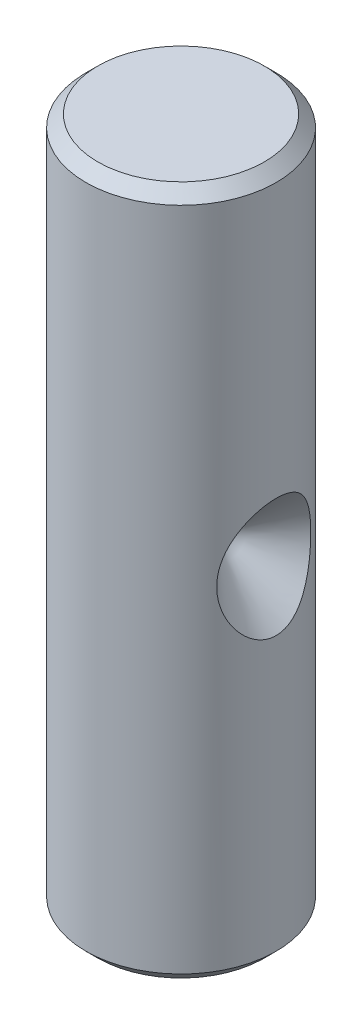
ISO-10303-21;
HEADER;
FILE_DESCRIPTION(('STEP AP214'),'2;1');
FILE_NAME('part.step','',(''),(''),'','','');
FILE_SCHEMA(('AUTOMOTIVE_DESIGN { 1 0 10303 214 1 1 1 1 }'));
ENDSEC;
DATA;
#1=APPLICATION_CONTEXT('core data for automotive mechanical design processes');
#2=APPLICATION_PROTOCOL_DEFINITION('international standard','automotive_design',2000,#1);
#3=PRODUCT_CONTEXT('',#1,'mechanical');
#4=PRODUCT('Part','Part','',(#3));
#5=PRODUCT_RELATED_PRODUCT_CATEGORY('part','',(#4));
#6=PRODUCT_DEFINITION_FORMATION('','',#4);
#7=PRODUCT_DEFINITION_CONTEXT('part definition',#1,'design');
#8=PRODUCT_DEFINITION('design','',#6,#7);
#9=PRODUCT_DEFINITION_SHAPE('','',#8);
#10=(LENGTH_UNIT() NAMED_UNIT(*) SI_UNIT(.MILLI.,.METRE.));
#11=(NAMED_UNIT(*) PLANE_ANGLE_UNIT() SI_UNIT($,.RADIAN.));
#12=(NAMED_UNIT(*) SI_UNIT($,.STERADIAN.) SOLID_ANGLE_UNIT());
#13=UNCERTAINTY_MEASURE_WITH_UNIT(LENGTH_MEASURE(1.E-05),#10,'distance_accuracy_value','');
#14=(GEOMETRIC_REPRESENTATION_CONTEXT(3) GLOBAL_UNCERTAINTY_ASSIGNED_CONTEXT((#13)) GLOBAL_UNIT_ASSIGNED_CONTEXT((#10,
#11,#12)) REPRESENTATION_CONTEXT('',''));
#15=CARTESIAN_POINT('',(0.,0.,0.));
#16=DIRECTION('',(0.,0.,1.));
#17=DIRECTION('',(1.,0.,0.));
#18=AXIS2_PLACEMENT_3D('',#15,#16,#17);
#19=CARTESIAN_POINT('',(0.,29.,0.));
#20=DIRECTION('',(0.,-1.,0.));
#21=DIRECTION('',(0.,0.,-1.));
#22=AXIS2_PLACEMENT_3D('',#19,#20,#21);
#23=CYLINDRICAL_SURFACE('',#22,4.);
#24=CARTESIAN_POINT('',(3.88606507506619,12.31029492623,-0.947891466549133));
#25=CARTESIAN_POINT('',(3.90453519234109,12.2573884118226,-0.872166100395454));
#26=CARTESIAN_POINT('',(3.92165342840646,12.2098031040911,-0.792364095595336));
#27=CARTESIAN_POINT('',(3.95169433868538,12.1276735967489,-0.62551987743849));
#28=CARTESIAN_POINT('',(3.96461939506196,12.093121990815,-0.538481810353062));
#29=CARTESIAN_POINT('',(3.98495496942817,12.0392277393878,-0.35832790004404));
#30=CARTESIAN_POINT('',(3.99231974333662,12.0200111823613,-0.265168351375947));
#31=CARTESIAN_POINT('',(4.00037530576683,11.9990071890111,-0.0766296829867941));
#32=CARTESIAN_POINT('',(4.00107104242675,11.9972068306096,0.0187477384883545));
#33=CARTESIAN_POINT('',(3.99606758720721,12.0102362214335,0.195538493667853));
#34=CARTESIAN_POINT('',(3.99119383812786,12.0229192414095,0.277144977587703));
#35=CARTESIAN_POINT('',(3.97686613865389,12.0606186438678,0.437012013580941));
#36=CARTESIAN_POINT('',(3.9674114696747,12.0856369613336,0.515272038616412));
#37=CARTESIAN_POINT('',(3.9444532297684,12.1473914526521,0.668958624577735));
#38=CARTESIAN_POINT('',(3.93084264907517,12.1844391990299,0.744242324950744));
#39=CARTESIAN_POINT('',(3.90075691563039,12.2682202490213,0.888561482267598));
#40=CARTESIAN_POINT('',(3.88427983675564,12.3149600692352,0.95759269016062));
#41=CARTESIAN_POINT('',(3.84066662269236,12.4423494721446,1.12240783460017));
#42=CARTESIAN_POINT('',(3.81237457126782,12.528148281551,1.21391964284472));
#43=CARTESIAN_POINT('',(3.7549482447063,12.7135525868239,1.38138872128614));
#44=CARTESIAN_POINT('',(3.72581249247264,12.8131836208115,1.45731656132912));
#45=CARTESIAN_POINT('',(3.66900251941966,13.0249038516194,1.5950124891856));
#46=CARTESIAN_POINT('',(3.64136539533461,13.137189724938,1.65649205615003));
#47=CARTESIAN_POINT('',(3.59074210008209,13.369998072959,1.76354027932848));
#48=CARTESIAN_POINT('',(3.56775473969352,13.4905184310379,1.80911300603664));
#49=CARTESIAN_POINT('',(3.52511891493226,13.7599332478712,1.8910508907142));
#50=CARTESIAN_POINT('',(3.5068251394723,13.9100186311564,1.92426251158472));
#51=CARTESIAN_POINT('',(3.4825538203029,14.2144456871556,1.96785538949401));
#52=CARTESIAN_POINT('',(3.47657593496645,14.3687872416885,1.97823727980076));
#53=CARTESIAN_POINT('',(3.4778742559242,14.6765366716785,1.9759532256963));
#54=CARTESIAN_POINT('',(3.48508983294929,14.8299455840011,1.96339271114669));
#55=CARTESIAN_POINT('',(3.51153452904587,15.1322180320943,1.91568546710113));
#56=CARTESIAN_POINT('',(3.53077149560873,15.2810785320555,1.88052398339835));
#57=CARTESIAN_POINT('',(3.57848623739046,15.5702844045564,1.78805264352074));
#58=CARTESIAN_POINT('',(3.6069710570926,15.7106231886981,1.73072589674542));
#59=CARTESIAN_POINT('',(3.66941839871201,15.9788656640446,1.59405326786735));
#60=CARTESIAN_POINT('',(3.70337827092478,16.1067753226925,1.51471802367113));
#61=CARTESIAN_POINT('',(3.76456607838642,16.3186163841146,1.35412934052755));
#62=CARTESIAN_POINT('',(3.79159266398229,16.4059725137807,1.27730982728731));
#63=CARTESIAN_POINT('',(3.84383841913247,16.5673169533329,1.11019771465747));
#64=CARTESIAN_POINT('',(3.86906061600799,16.6413279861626,1.01992850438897));
#65=CARTESIAN_POINT('',(3.90995464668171,16.7577871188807,0.847527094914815));
#66=CARTESIAN_POINT('',(3.92651090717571,16.8035991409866,0.767886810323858));
#67=CARTESIAN_POINT('',(3.95538538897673,16.8822519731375,0.601679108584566));
#68=CARTESIAN_POINT('',(3.96770659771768,16.9151019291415,0.515116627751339));
#69=CARTESIAN_POINT('',(3.9868578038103,16.9657589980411,0.336297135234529));
#70=CARTESIAN_POINT('',(3.99364450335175,16.9834475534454,0.244001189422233));
#71=CARTESIAN_POINT('',(4.00067242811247,17.001761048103,0.0574898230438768));
#72=CARTESIAN_POINT('',(4.00091764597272,17.0023963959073,-0.0367243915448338));
#73=CARTESIAN_POINT('',(3.99522431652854,16.9875659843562,-0.211947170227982));
#74=CARTESIAN_POINT('',(3.9900410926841,16.9740669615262,-0.293157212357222));
#75=CARTESIAN_POINT('',(3.97516788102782,16.9348895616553,-0.452125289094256));
#76=CARTESIAN_POINT('',(3.96547716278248,16.9092092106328,-0.529882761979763));
#77=CARTESIAN_POINT('',(3.94204070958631,16.8460585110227,-0.683034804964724));
#78=CARTESIAN_POINT('',(3.92816370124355,16.8082033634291,-0.758248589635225));
#79=CARTESIAN_POINT('',(3.89759273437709,16.7228438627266,-0.90233450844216));
#80=CARTESIAN_POINT('',(3.88089682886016,16.6753328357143,-0.971202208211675));
#81=CARTESIAN_POINT('',(3.83672610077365,16.5458282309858,-1.13581291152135));
#82=CARTESIAN_POINT('',(3.8081192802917,16.4586569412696,-1.2271933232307));
#83=CARTESIAN_POINT('',(3.75021081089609,16.2705154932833,-1.39418920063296));
#84=CARTESIAN_POINT('',(3.720907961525,16.1695198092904,-1.4697748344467));
#85=CARTESIAN_POINT('',(3.66395168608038,15.955083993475,-1.6065622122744));
#86=CARTESIAN_POINT('',(3.63633834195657,15.8414496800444,-1.66747488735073));
#87=CARTESIAN_POINT('',(3.5859846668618,15.605990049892,-1.77317190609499));
#88=CARTESIAN_POINT('',(3.56324298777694,15.4841670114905,-1.81796071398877));
#89=CARTESIAN_POINT('',(3.5215138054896,15.2127259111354,-1.89772018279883));
#90=CARTESIAN_POINT('',(3.50387990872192,15.0619747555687,-1.92960065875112));
#91=CARTESIAN_POINT('',(3.48109322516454,14.7564753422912,-1.9704186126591));
#92=CARTESIAN_POINT('',(3.47593972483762,14.6017273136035,-1.97935740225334));
#93=CARTESIAN_POINT('',(3.47891541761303,14.2939152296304,-1.97412081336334));
#94=CARTESIAN_POINT('',(3.48694541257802,14.1408472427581,-1.96011805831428));
#95=CARTESIAN_POINT('',(3.51485957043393,13.8394879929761,-1.90960117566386));
#96=CARTESIAN_POINT('',(3.53475327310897,13.6912006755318,-1.87306893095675));
#97=CARTESIAN_POINT('',(3.58360982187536,13.4030164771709,-1.77780860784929));
#98=CARTESIAN_POINT('',(3.612601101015,13.2631475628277,-1.7190108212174));
#99=CARTESIAN_POINT('',(3.67579974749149,12.9962012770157,-1.57935439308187));
#100=CARTESIAN_POINT('',(3.71000160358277,12.8691106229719,-1.49851899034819));
#101=CARTESIAN_POINT('',(3.76904388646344,12.6669410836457,-1.34132360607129));
#102=CARTESIAN_POINT('',(3.79371373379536,12.5874858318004,-1.27050047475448));
#103=CARTESIAN_POINT('',(3.84154541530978,12.4397557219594,-1.11755684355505));
#104=CARTESIAN_POINT('',(3.86470892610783,12.3714683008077,-1.03544923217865));
#105=CARTESIAN_POINT('',(3.88606507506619,12.31029492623,-0.947891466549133));
#106=B_SPLINE_CURVE_WITH_KNOTS('',3,(#24,#25,#26,#27,#28,#29,#30,#31,#32,#33,#34,#35,#36,#37,
#38,#39,#40,#41,#42,#43,#44,#45,#46,#47,#48,#49,#50,#51,#52,#53,#54,#55,#56,#57,#58,#59,#60,#61,
#62,#63,#64,#65,#66,#67,#68,#69,#70,#71,#72,#73,#74,#75,#76,#77,#78,#79,#80,#81,#82,#83,#84,#85,
#86,#87,#88,#89,#90,#91,#92,#93,#94,#95,#96,#97,#98,#99,#100,#101,#102,#103,#104,#105),
.UNSPECIFIED.,.T.,.F.,(4,2,2,2,2,2,2,2,2,2,2,2,2,2,2,2,2,2,2,2,2,2,2,2,2,2,2,2,2,2,2,2,2,2,2,2,
2,2,2,2,4),(0.,0.282332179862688,0.564503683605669,0.84897203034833,1.13322929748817,
1.38026502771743,1.62733952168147,1.88140608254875,2.13564402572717,2.51931590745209,
2.90370581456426,3.29522005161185,3.68663402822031,4.14880190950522,4.61095697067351,
5.07099357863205,5.53133080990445,5.99201952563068,6.45248595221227,6.80951911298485,
7.16593848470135,7.44493499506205,7.72373429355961,8.00469432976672,8.28548287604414,
8.53180641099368,8.77816987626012,9.03324508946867,9.28849720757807,9.6748438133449,
10.0619136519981,10.4560788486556,10.8501348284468,11.3131560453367,11.7761507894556,
12.2356777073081,12.6955746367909,13.1569234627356,13.6177876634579,13.9446056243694,
14.2710533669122),.UNSPECIFIED.);
#107=CARTESIAN_POINT('',(3.88606507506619,12.31029492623,-0.947891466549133));
#108=VERTEX_POINT('',#107);
#109=EDGE_CURVE('E48',#108,#108,#106,.T.);
#110=ORIENTED_EDGE('',*,*,#109,.T.);
#111=EDGE_LOOP('',(#110));
#112=FACE_BOUND('',#111,.T.);
#113=CARTESIAN_POINT('',(0.,0.500000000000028,0.));
#114=DIRECTION('',(0.,1.,0.));
#115=DIRECTION('',(0.,0.,1.));
#116=AXIS2_PLACEMENT_3D('',#113,#114,#115);
#117=CIRCLE('',#116,4.);
#118=CARTESIAN_POINT('',(0.,0.500000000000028,4.));
#119=VERTEX_POINT('',#118);
#120=EDGE_CURVE('E67',#119,#119,#117,.T.);
#121=ORIENTED_EDGE('',*,*,#120,.T.);
#122=EDGE_LOOP('',(#121));
#123=FACE_BOUND('',#122,.T.);
#124=CARTESIAN_POINT('',(0.,28.5,0.));
#125=DIRECTION('',(0.,1.,0.));
#126=DIRECTION('',(0.,0.,1.));
#127=AXIS2_PLACEMENT_3D('',#124,#125,#126);
#128=CIRCLE('',#127,4.);
#129=CARTESIAN_POINT('',(0.,28.5,4.));
#130=VERTEX_POINT('',#129);
#131=EDGE_CURVE('E65',#130,#130,#128,.F.);
#132=ORIENTED_EDGE('',*,*,#131,.T.);
#133=EDGE_LOOP('',(#132));
#134=FACE_BOUND('',#133,.T.);
#135=ADVANCED_FACE('F44',(#112,#123,#134),#23,.T.);
#136=CARTESIAN_POINT('',(0.,29.,0.));
#137=DIRECTION('',(0.,1.,0.));
#138=DIRECTION('',(0.,0.,1.));
#139=AXIS2_PLACEMENT_3D('',#136,#137,#138);
#140=PLANE('',#139);
#141=CARTESIAN_POINT('',(0.,29.,0.));
#142=DIRECTION('',(0.,1.,0.));
#143=DIRECTION('',(0.,0.,1.));
#144=AXIS2_PLACEMENT_3D('',#141,#142,#143);
#145=CIRCLE('',#144,3.50000000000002);
#146=CARTESIAN_POINT('',(0.,29.,3.50000000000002));
#147=VERTEX_POINT('',#146);
#148=EDGE_CURVE('E13',#147,#147,#145,.T.);
#149=ORIENTED_EDGE('',*,*,#148,.T.);
#150=EDGE_LOOP('',(#149));
#151=FACE_BOUND('',#150,.T.);
#152=ADVANCED_FACE('F85',(#151),#140,.T.);
#153=CARTESIAN_POINT('',(0.,0.,0.));
#154=DIRECTION('',(0.,1.,0.));
#155=DIRECTION('',(0.,0.,1.));
#156=AXIS2_PLACEMENT_3D('',#153,#154,#155);
#157=PLANE('',#156);
#158=CARTESIAN_POINT('',(0.,0.,0.));
#159=DIRECTION('',(0.,1.,0.));
#160=DIRECTION('',(0.,0.,1.));
#161=AXIS2_PLACEMENT_3D('',#158,#159,#160);
#162=CIRCLE('',#161,3.49999999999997);
#163=CARTESIAN_POINT('',(0.,0.,3.49999999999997));
#164=VERTEX_POINT('',#163);
#165=EDGE_CURVE('E56',#164,#164,#162,.F.);
#166=ORIENTED_EDGE('',*,*,#165,.T.);
#167=EDGE_LOOP('',(#166));
#168=FACE_BOUND('',#167,.T.);
#169=ADVANCED_FACE('F77',(#168),#157,.F.);
#170=CARTESIAN_POINT('',(0.,0.500000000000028,0.));
#171=DIRECTION('',(0.,1.,0.));
#172=DIRECTION('',(0.,0.,1.));
#173=AXIS2_PLACEMENT_3D('',#170,#171,#172);
#174=CONICAL_SURFACE('',#173,4.,0.785398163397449);
#175=ORIENTED_EDGE('',*,*,#165,.F.);
#176=EDGE_LOOP('',(#175));
#177=FACE_BOUND('',#176,.T.);
#178=ORIENTED_EDGE('',*,*,#120,.F.);
#179=EDGE_LOOP('',(#178));
#180=FACE_BOUND('',#179,.T.);
#181=ADVANCED_FACE('F79',(#177,#180),#174,.T.);
#182=CARTESIAN_POINT('',(0.,29.,0.));
#183=DIRECTION('',(0.,-1.,0.));
#184=DIRECTION('',(0.,0.,-1.));
#185=AXIS2_PLACEMENT_3D('',#182,#183,#184);
#186=CONICAL_SURFACE('',#185,3.50000000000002,0.785398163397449);
#187=ORIENTED_EDGE('',*,*,#131,.F.);
#188=EDGE_LOOP('',(#187));
#189=FACE_BOUND('',#188,.T.);
#190=ORIENTED_EDGE('',*,*,#148,.F.);
#191=EDGE_LOOP('',(#190));
#192=FACE_BOUND('',#191,.T.);
#193=ADVANCED_FACE('F46',(#189,#192),#186,.T.);
#194=CARTESIAN_POINT('',(9.30216698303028,14.5,0.));
#195=DIRECTION('',(1.,0.,0.));
#196=DIRECTION('',(0.,0.,-1.));
#197=AXIS2_PLACEMENT_3D('',#194,#195,#196);
#198=CONICAL_SURFACE('',#197,7.80216698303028,0.785398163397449);
#199=CARTESIAN_POINT('',(1.5,14.5,0.));
#200=VERTEX_POINT('',#199);
#201=VERTEX_LOOP('',#200);
#202=FACE_BOUND('',#201,.T.);
#203=ORIENTED_EDGE('',*,*,#109,.F.);
#204=EDGE_LOOP('',(#203));
#205=FACE_BOUND('',#204,.T.);
#206=ADVANCED_FACE('F59',(#202,#205),#198,.F.);
#207=CLOSED_SHELL('',(#135,#152,#169,#181,#193,#206));
#208=MANIFOLD_SOLID_BREP('B2',#207);
#209=ADVANCED_BREP_SHAPE_REPRESENTATION('',(#18,#208),#14);
#210=SHAPE_DEFINITION_REPRESENTATION(#9,#209);
ENDSEC;
END-ISO-10303-21;
